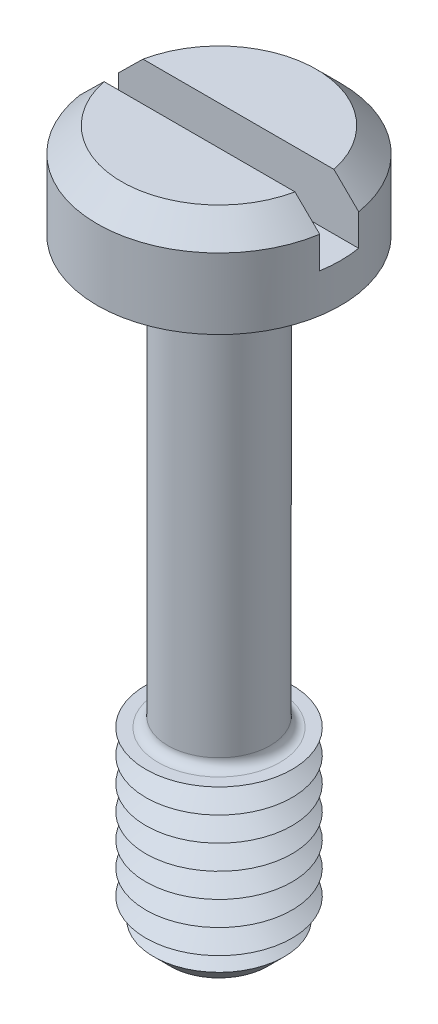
from build123d import *

# Parameters (mm, degrees)
SKETCH1_R           = 5
BOSS_EXTRUDE1_DEPTH = 3.9
SKETCH2_R           = 2.1
BOSS_EXTRUDE2_DEPTH = 25
SKETCH3_R           = 3
BOSS_EXTRUDE3_DEPTH = 7.5
CHAMFER1_SIZE       = 1
LPATTERN1_COUNT     = 7
LPATTERN1_PITCH     = 1
FILLET1_R           = 0.4
CHAMFER2_SIZE       = 1
SKETCH6_W           = 10
SKETCH6_H           = 1.6
CUT_EXTRUDE1_DEPTH  = 2.3


with BuildPart() as part:
    # Sketch1 → Boss-Extrude1 (new body)
    with BuildSketch(Plane(origin=(0, 0, 0), x_dir=(1, 0, 0), z_dir=(0, 1, 0))):
        with Locations(Location((0, 0, 0), (0, 0, 270))):
            Circle(SKETCH1_R)
    extrude(amount=BOSS_EXTRUDE1_DEPTH)

    # Sketch2 → Boss-Extrude2 (add)
    with BuildSketch(Plane.XZ):
        with Locations(Location((0, 0, 0), (0, 0, 270))):
            Circle(SKETCH2_R)
    extrude(amount=BOSS_EXTRUDE2_DEPTH)

    # Sketch3 → Boss-Extrude3 (add)
    with BuildSketch(Plane.XZ.offset(25)):
        with Locations(Location((0, 0, 0), (0, 0, 270))):
            Circle(SKETCH3_R)
    extrude(amount=-BOSS_EXTRUDE3_DEPTH)

    # Chamfer1
    chamfer1_edges = [part.edges().sort_by_distance(p)[0] for p in [
        (0, -25, 3),
    ]]
    chamfer(chamfer1_edges, length=CHAMFER1_SIZE)

    # Sketch5 → Cut-Revolve1 (revolve, cut)
    with BuildSketch(Plane(origin=(0, 0, 0), x_dir=(0, 0, -1), z_dir=(1, 0, 0))):
        Polygon((-3, -17.5), (-2.133974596, -18), (-3, -18.5), align=None)
    cut_revolve1 = revolve(axis=Axis((0, -6.58711856, 0), (0, -1, 0)), mode=Mode.SUBTRACT)

    # LPattern1: Cut-Revolve1 ×7
    with Locations(*[(0, -i * LPATTERN1_PITCH, 0) for i in range(1, LPATTERN1_COUNT)]):
        add(cut_revolve1, mode=Mode.SUBTRACT)

    # Fillet1
    fillet1_edges = [part.edges().sort_by_distance(p)[0] for p in [
        (0, 0, 2.1),
        (0, -17.5, 2.1),
    ]]
    fillet(fillet1_edges, radius=FILLET1_R)

    # Chamfer2
    chamfer2_edges = [part.edges().sort_by_distance(p)[0] for p in [
        (0, 3.9, -5),
    ]]
    chamfer(chamfer2_edges, length=CHAMFER2_SIZE)

    # Sketch6 → Cut-Extrude1 (cut)
    with BuildSketch(Plane(origin=(0, 3.9, 0), x_dir=(1, 0, 0), z_dir=(0, 1, 0))):
        Rectangle(SKETCH6_W, SKETCH6_H)
    extrude(amount=-CUT_EXTRUDE1_DEPTH, mode=Mode.SUBTRACT)


solid = part.part
